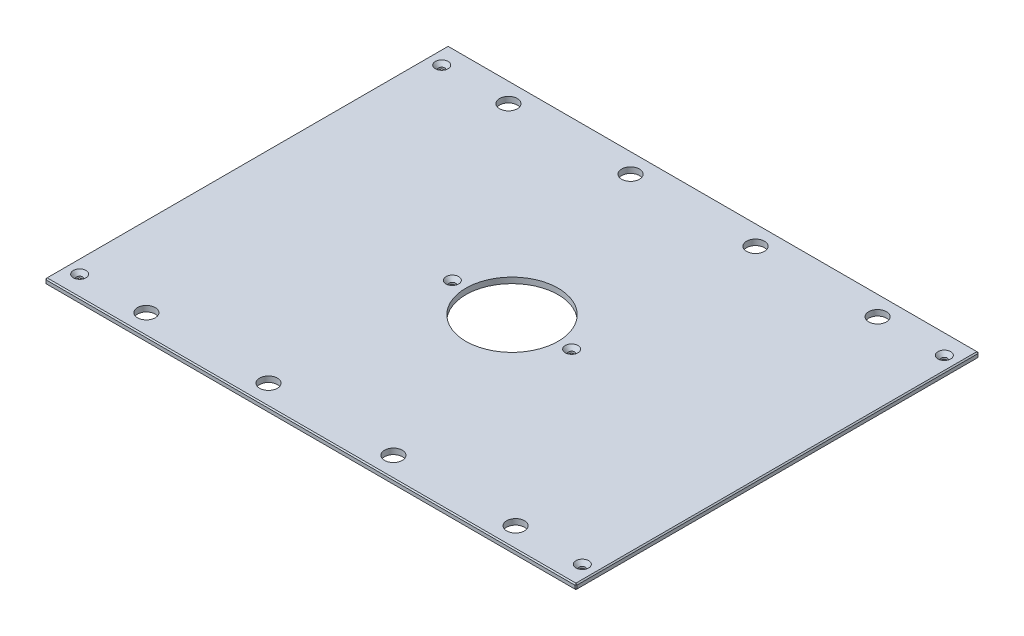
ISO-10303-21;
HEADER;
FILE_DESCRIPTION(('STEP AP214'),'2;1');
FILE_NAME('part.step','',(''),(''),'','','');
FILE_SCHEMA(('AUTOMOTIVE_DESIGN { 1 0 10303 214 1 1 1 1 }'));
ENDSEC;
DATA;
#1=APPLICATION_CONTEXT('core data for automotive mechanical design processes');
#2=APPLICATION_PROTOCOL_DEFINITION('international standard','automotive_design',2000,#1);
#3=PRODUCT_CONTEXT('',#1,'mechanical');
#4=PRODUCT('Part','Part','',(#3));
#5=PRODUCT_RELATED_PRODUCT_CATEGORY('part','',(#4));
#6=PRODUCT_DEFINITION_FORMATION('','',#4);
#7=PRODUCT_DEFINITION_CONTEXT('part definition',#1,'design');
#8=PRODUCT_DEFINITION('design','',#6,#7);
#9=PRODUCT_DEFINITION_SHAPE('','',#8);
#10=(LENGTH_UNIT() NAMED_UNIT(*) SI_UNIT(.MILLI.,.METRE.));
#11=(NAMED_UNIT(*) PLANE_ANGLE_UNIT() SI_UNIT($,.RADIAN.));
#12=(NAMED_UNIT(*) SI_UNIT($,.STERADIAN.) SOLID_ANGLE_UNIT());
#13=UNCERTAINTY_MEASURE_WITH_UNIT(LENGTH_MEASURE(1.E-05),#10,'distance_accuracy_value','');
#14=(GEOMETRIC_REPRESENTATION_CONTEXT(3) GLOBAL_UNCERTAINTY_ASSIGNED_CONTEXT((#13)) GLOBAL_UNIT_ASSIGNED_CONTEXT((#10,
#11,#12)) REPRESENTATION_CONTEXT('',''));
#15=CARTESIAN_POINT('',(0.,0.,0.));
#16=DIRECTION('',(0.,0.,1.));
#17=DIRECTION('',(1.,0.,0.));
#18=AXIS2_PLACEMENT_3D('',#15,#16,#17);
#19=CARTESIAN_POINT('',(-296.8625,6.35,-225.425));
#20=DIRECTION('',(1.,0.,0.));
#21=DIRECTION('',(0.,0.,-1.));
#22=AXIS2_PLACEMENT_3D('',#19,#20,#21);
#23=PLANE('',#22);
#24=DIRECTION('',(0.,0.,-1.));
#25=VECTOR('',#24,1.);
#26=CARTESIAN_POINT('',(-296.8625,5.08000000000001,-225.425));
#27=LINE('',#26,#25);
#28=CARTESIAN_POINT('',(-296.8625,5.08000000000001,224.155));
#29=VERTEX_POINT('',#28);
#30=CARTESIAN_POINT('',(-296.8625,5.08000000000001,-224.155));
#31=VERTEX_POINT('',#30);
#32=EDGE_CURVE('E134',#29,#31,#27,.T.);
#33=ORIENTED_EDGE('',*,*,#32,.T.);
#34=DIRECTION('',(0.,-1.,0.));
#35=VECTOR('',#34,1.);
#36=CARTESIAN_POINT('',(-296.8625,6.35,-224.155));
#37=LINE('',#36,#35);
#38=CARTESIAN_POINT('',(-296.8625,1.26999999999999,-224.155));
#39=VERTEX_POINT('',#38);
#40=EDGE_CURVE('E130',#31,#39,#37,.T.);
#41=ORIENTED_EDGE('',*,*,#40,.T.);
#42=DIRECTION('',(0.,0.,1.));
#43=VECTOR('',#42,1.);
#44=CARTESIAN_POINT('',(-296.8625,1.26999999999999,-225.425));
#45=LINE('',#44,#43);
#46=CARTESIAN_POINT('',(-296.8625,1.26999999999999,224.155));
#47=VERTEX_POINT('',#46);
#48=EDGE_CURVE('E125',#39,#47,#45,.T.);
#49=ORIENTED_EDGE('',*,*,#48,.T.);
#50=DIRECTION('',(0.,1.,0.));
#51=VECTOR('',#50,1.);
#52=CARTESIAN_POINT('',(-296.8625,6.35,224.155));
#53=LINE('',#52,#51);
#54=EDGE_CURVE('E127',#47,#29,#53,.T.);
#55=ORIENTED_EDGE('',*,*,#54,.T.);
#56=EDGE_LOOP('',(#33,#41,#49,#55));
#57=FACE_BOUND('',#56,.T.);
#58=ADVANCED_FACE('F34',(#57),#23,.F.);
#59=CARTESIAN_POINT('',(-296.8625,6.35,225.425));
#60=DIRECTION('',(0.,0.,-1.));
#61=DIRECTION('',(-1.,0.,0.));
#62=AXIS2_PLACEMENT_3D('',#59,#60,#61);
#63=PLANE('',#62);
#64=DIRECTION('',(1.,0.,0.));
#65=VECTOR('',#64,1.);
#66=CARTESIAN_POINT('',(-296.8625,1.26999999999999,225.425));
#67=LINE('',#66,#65);
#68=CARTESIAN_POINT('',(-295.5925,1.26999999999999,225.425));
#69=VERTEX_POINT('',#68);
#70=CARTESIAN_POINT('',(295.5925,1.26999999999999,225.425));
#71=VERTEX_POINT('',#70);
#72=EDGE_CURVE('E57',#69,#71,#67,.T.);
#73=ORIENTED_EDGE('',*,*,#72,.T.);
#74=DIRECTION('',(0.,1.,0.));
#75=VECTOR('',#74,1.);
#76=CARTESIAN_POINT('',(295.5925,6.35,225.425));
#77=LINE('',#76,#75);
#78=CARTESIAN_POINT('',(295.5925,5.08000000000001,225.425));
#79=VERTEX_POINT('',#78);
#80=EDGE_CURVE('E11',#71,#79,#77,.T.);
#81=ORIENTED_EDGE('',*,*,#80,.T.);
#82=DIRECTION('',(-1.,0.,0.));
#83=VECTOR('',#82,1.);
#84=CARTESIAN_POINT('',(-296.8625,5.08000000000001,225.425));
#85=LINE('',#84,#83);
#86=CARTESIAN_POINT('',(-295.5925,5.08000000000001,225.425));
#87=VERTEX_POINT('',#86);
#88=EDGE_CURVE('E43',#79,#87,#85,.T.);
#89=ORIENTED_EDGE('',*,*,#88,.T.);
#90=DIRECTION('',(0.,-1.,0.));
#91=VECTOR('',#90,1.);
#92=CARTESIAN_POINT('',(-295.5925,6.35,225.425));
#93=LINE('',#92,#91);
#94=EDGE_CURVE('E302',#87,#69,#93,.T.);
#95=ORIENTED_EDGE('',*,*,#94,.T.);
#96=EDGE_LOOP('',(#73,#81,#89,#95));
#97=FACE_BOUND('',#96,.T.);
#98=ADVANCED_FACE('F371',(#97),#63,.F.);
#99=CARTESIAN_POINT('',(296.8625,6.35,-225.425));
#100=DIRECTION('',(-1.,0.,0.));
#101=DIRECTION('',(0.,0.,1.));
#102=AXIS2_PLACEMENT_3D('',#99,#100,#101);
#103=PLANE('',#102);
#104=DIRECTION('',(0.,0.,-1.));
#105=VECTOR('',#104,1.);
#106=CARTESIAN_POINT('',(296.8625,1.26999999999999,-225.425));
#107=LINE('',#106,#105);
#108=CARTESIAN_POINT('',(296.8625,1.26999999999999,224.155));
#109=VERTEX_POINT('',#108);
#110=CARTESIAN_POINT('',(296.8625,1.26999999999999,-224.155));
#111=VERTEX_POINT('',#110);
#112=EDGE_CURVE('E297',#109,#111,#107,.T.);
#113=ORIENTED_EDGE('',*,*,#112,.T.);
#114=DIRECTION('',(0.,1.,0.));
#115=VECTOR('',#114,1.);
#116=CARTESIAN_POINT('',(296.8625,6.35,-224.155));
#117=LINE('',#116,#115);
#118=CARTESIAN_POINT('',(296.8625,5.08000000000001,-224.155));
#119=VERTEX_POINT('',#118);
#120=EDGE_CURVE('E299',#111,#119,#117,.T.);
#121=ORIENTED_EDGE('',*,*,#120,.T.);
#122=DIRECTION('',(0.,0.,1.));
#123=VECTOR('',#122,1.);
#124=CARTESIAN_POINT('',(296.8625,5.08000000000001,225.425));
#125=LINE('',#124,#123);
#126=CARTESIAN_POINT('',(296.8625,5.08000000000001,224.155));
#127=VERTEX_POINT('',#126);
#128=EDGE_CURVE('E295',#119,#127,#125,.T.);
#129=ORIENTED_EDGE('',*,*,#128,.T.);
#130=DIRECTION('',(0.,-1.,0.));
#131=VECTOR('',#130,1.);
#132=CARTESIAN_POINT('',(296.8625,6.35,224.155));
#133=LINE('',#132,#131);
#134=EDGE_CURVE('E293',#127,#109,#133,.T.);
#135=ORIENTED_EDGE('',*,*,#134,.T.);
#136=EDGE_LOOP('',(#113,#121,#129,#135));
#137=FACE_BOUND('',#136,.T.);
#138=ADVANCED_FACE('F358',(#137),#103,.F.);
#139=CARTESIAN_POINT('',(-296.8625,6.35,-225.425));
#140=DIRECTION('',(0.,0.,1.));
#141=DIRECTION('',(1.,0.,0.));
#142=AXIS2_PLACEMENT_3D('',#139,#140,#141);
#143=PLANE('',#142);
#144=DIRECTION('',(-1.,0.,0.));
#145=VECTOR('',#144,1.);
#146=CARTESIAN_POINT('',(-296.8625,1.26999999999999,-225.425));
#147=LINE('',#146,#145);
#148=CARTESIAN_POINT('',(295.5925,1.26999999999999,-225.425));
#149=VERTEX_POINT('',#148);
#150=CARTESIAN_POINT('',(-295.5925,1.26999999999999,-225.425));
#151=VERTEX_POINT('',#150);
#152=EDGE_CURVE('E269',#149,#151,#147,.T.);
#153=ORIENTED_EDGE('',*,*,#152,.T.);
#154=DIRECTION('',(0.,1.,0.));
#155=VECTOR('',#154,1.);
#156=CARTESIAN_POINT('',(-295.5925,6.35,-225.425));
#157=LINE('',#156,#155);
#158=CARTESIAN_POINT('',(-295.5925,5.08000000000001,-225.425));
#159=VERTEX_POINT('',#158);
#160=EDGE_CURVE('E273',#151,#159,#157,.T.);
#161=ORIENTED_EDGE('',*,*,#160,.T.);
#162=DIRECTION('',(1.,0.,0.));
#163=VECTOR('',#162,1.);
#164=CARTESIAN_POINT('',(296.8625,5.08000000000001,-225.425));
#165=LINE('',#164,#163);
#166=CARTESIAN_POINT('',(295.5925,5.08000000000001,-225.425));
#167=VERTEX_POINT('',#166);
#168=EDGE_CURVE('E271',#159,#167,#165,.T.);
#169=ORIENTED_EDGE('',*,*,#168,.T.);
#170=DIRECTION('',(0.,-1.,0.));
#171=VECTOR('',#170,1.);
#172=CARTESIAN_POINT('',(295.5925,6.35,-225.425));
#173=LINE('',#172,#171);
#174=EDGE_CURVE('E267',#167,#149,#173,.T.);
#175=ORIENTED_EDGE('',*,*,#174,.T.);
#176=EDGE_LOOP('',(#153,#161,#169,#175));
#177=FACE_BOUND('',#176,.T.);
#178=ADVANCED_FACE('F332',(#177),#143,.F.);
#179=CARTESIAN_POINT('',(0.,6.35,0.));
#180=DIRECTION('',(0.,1.,0.));
#181=DIRECTION('',(0.,0.,1.));
#182=AXIS2_PLACEMENT_3D('',#179,#180,#181);
#183=PLANE('',#182);
#184=CARTESIAN_POINT('',(280.9875,6.35,-202.40498));
#185=DIRECTION('',(0.,1.,0.));
#186=DIRECTION('',(0.,0.,1.));
#187=AXIS2_PLACEMENT_3D('',#184,#185,#186);
#188=CIRCLE('',#187,7.13740000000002);
#189=CARTESIAN_POINT('',(280.9875,6.35,-195.26758));
#190=VERTEX_POINT('',#189);
#191=EDGE_CURVE('E815',#190,#190,#188,.T.);
#192=ORIENTED_EDGE('',*,*,#191,.F.);
#193=EDGE_LOOP('',(#192));
#194=FACE_BOUND('',#193,.T.);
#195=CARTESIAN_POINT('',(280.9875,6.35,202.40498));
#196=DIRECTION('',(0.,1.,0.));
#197=DIRECTION('',(0.,0.,1.));
#198=AXIS2_PLACEMENT_3D('',#195,#196,#197);
#199=CIRCLE('',#198,7.13740000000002);
#200=CARTESIAN_POINT('',(280.9875,6.35,209.54238));
#201=VERTEX_POINT('',#200);
#202=EDGE_CURVE('E819',#201,#201,#199,.T.);
#203=ORIENTED_EDGE('',*,*,#202,.F.);
#204=EDGE_LOOP('',(#203));
#205=FACE_BOUND('',#204,.T.);
#206=CARTESIAN_POINT('',(-280.9875,6.35,202.40498));
#207=DIRECTION('',(0.,1.,0.));
#208=DIRECTION('',(0.,0.,1.));
#209=AXIS2_PLACEMENT_3D('',#206,#207,#208);
#210=CIRCLE('',#209,7.13740000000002);
#211=CARTESIAN_POINT('',(-280.9875,6.35,209.54238));
#212=VERTEX_POINT('',#211);
#213=EDGE_CURVE('E823',#212,#212,#210,.T.);
#214=ORIENTED_EDGE('',*,*,#213,.F.);
#215=EDGE_LOOP('',(#214));
#216=FACE_BOUND('',#215,.T.);
#217=CARTESIAN_POINT('',(-66.675,6.35,0.));
#218=DIRECTION('',(0.,1.,0.));
#219=DIRECTION('',(0.,0.,1.));
#220=AXIS2_PLACEMENT_3D('',#217,#218,#219);
#221=CIRCLE('',#220,7.1374);
#222=CARTESIAN_POINT('',(-66.675,6.35,7.1374));
#223=VERTEX_POINT('',#222);
#224=EDGE_CURVE('E827',#223,#223,#221,.T.);
#225=ORIENTED_EDGE('',*,*,#224,.F.);
#226=EDGE_LOOP('',(#225));
#227=FACE_BOUND('',#226,.T.);
#228=CARTESIAN_POINT('',(66.675,6.35,0.));
#229=DIRECTION('',(0.,1.,0.));
#230=DIRECTION('',(0.,0.,1.));
#231=AXIS2_PLACEMENT_3D('',#228,#229,#230);
#232=CIRCLE('',#231,7.1374);
#233=CARTESIAN_POINT('',(66.675,6.35,7.1374));
#234=VERTEX_POINT('',#233);
#235=EDGE_CURVE('E831',#234,#234,#232,.T.);
#236=ORIENTED_EDGE('',*,*,#235,.F.);
#237=EDGE_LOOP('',(#236));
#238=FACE_BOUND('',#237,.T.);
#239=CARTESIAN_POINT('',(-280.9875,6.35,-202.40498));
#240=DIRECTION('',(0.,1.,0.));
#241=DIRECTION('',(0.,0.,1.));
#242=AXIS2_PLACEMENT_3D('',#239,#240,#241);
#243=CIRCLE('',#242,7.13740000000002);
#244=CARTESIAN_POINT('',(-280.9875,6.35,-195.26758));
#245=VERTEX_POINT('',#244);
#246=EDGE_CURVE('E834',#245,#245,#243,.T.);
#247=ORIENTED_EDGE('',*,*,#246,.F.);
#248=EDGE_LOOP('',(#247));
#249=FACE_BOUND('',#248,.T.);
#250=DIRECTION('',(0.,0.,-1.));
#251=VECTOR('',#250,1.);
#252=CARTESIAN_POINT('',(295.5925,6.35,-225.425));
#253=LINE('',#252,#251);
#254=CARTESIAN_POINT('',(295.5925,6.35,224.155));
#255=VERTEX_POINT('',#254);
#256=CARTESIAN_POINT('',(295.5925,6.35,-224.155));
#257=VERTEX_POINT('',#256);
#258=EDGE_CURVE('E280',#255,#257,#253,.T.);
#259=ORIENTED_EDGE('',*,*,#258,.T.);
#260=DIRECTION('',(-1.,0.,0.));
#261=VECTOR('',#260,1.);
#262=CARTESIAN_POINT('',(-296.8625,6.35,-224.155));
#263=LINE('',#262,#261);
#264=CARTESIAN_POINT('',(-295.5925,6.35,-224.155));
#265=VERTEX_POINT('',#264);
#266=EDGE_CURVE('E282',#257,#265,#263,.T.);
#267=ORIENTED_EDGE('',*,*,#266,.T.);
#268=DIRECTION('',(0.,0.,1.));
#269=VECTOR('',#268,1.);
#270=CARTESIAN_POINT('',(-295.5925,6.35,225.425));
#271=LINE('',#270,#269);
#272=CARTESIAN_POINT('',(-295.5925,6.35,224.155));
#273=VERTEX_POINT('',#272);
#274=EDGE_CURVE('E278',#265,#273,#271,.T.);
#275=ORIENTED_EDGE('',*,*,#274,.T.);
#276=DIRECTION('',(1.,0.,0.));
#277=VECTOR('',#276,1.);
#278=CARTESIAN_POINT('',(296.8625,6.35,224.155));
#279=LINE('',#278,#277);
#280=EDGE_CURVE('E276',#273,#255,#279,.T.);
#281=ORIENTED_EDGE('',*,*,#280,.T.);
#282=EDGE_LOOP('',(#259,#267,#275,#281));
#283=FACE_BOUND('',#282,.T.);
#284=CARTESIAN_POINT('',(206.375,6.35,-202.40498));
#285=DIRECTION('',(0.,1.,0.));
#286=DIRECTION('',(0.,0.,1.));
#287=AXIS2_PLACEMENT_3D('',#284,#285,#286);
#288=CIRCLE('',#287,9.921875);
#289=CARTESIAN_POINT('',(206.375,6.35,-192.483105));
#290=VERTEX_POINT('',#289);
#291=EDGE_CURVE('E203',#290,#290,#288,.T.);
#292=ORIENTED_EDGE('',*,*,#291,.F.);
#293=EDGE_LOOP('',(#292));
#294=FACE_BOUND('',#293,.T.);
#295=CARTESIAN_POINT('',(-206.375,6.35,-202.40498));
#296=DIRECTION('',(0.,1.,0.));
#297=DIRECTION('',(0.,0.,1.));
#298=AXIS2_PLACEMENT_3D('',#295,#296,#297);
#299=CIRCLE('',#298,9.921875);
#300=CARTESIAN_POINT('',(-206.375,6.35,-192.483105));
#301=VERTEX_POINT('',#300);
#302=EDGE_CURVE('E213',#301,#301,#299,.T.);
#303=ORIENTED_EDGE('',*,*,#302,.F.);
#304=EDGE_LOOP('',(#303));
#305=FACE_BOUND('',#304,.T.);
#306=CARTESIAN_POINT('',(206.375,6.35,202.40498));
#307=DIRECTION('',(0.,1.,0.));
#308=DIRECTION('',(0.,0.,1.));
#309=AXIS2_PLACEMENT_3D('',#306,#307,#308);
#310=CIRCLE('',#309,9.921875);
#311=CARTESIAN_POINT('',(206.375,6.35,212.326855));
#312=VERTEX_POINT('',#311);
#313=EDGE_CURVE('E224',#312,#312,#310,.T.);
#314=ORIENTED_EDGE('',*,*,#313,.F.);
#315=EDGE_LOOP('',(#314));
#316=FACE_BOUND('',#315,.T.);
#317=CARTESIAN_POINT('',(-206.375,6.35,202.40498));
#318=DIRECTION('',(0.,1.,0.));
#319=DIRECTION('',(0.,0.,1.));
#320=AXIS2_PLACEMENT_3D('',#317,#318,#319);
#321=CIRCLE('',#320,9.921875);
#322=CARTESIAN_POINT('',(-206.375,6.35,212.326855));
#323=VERTEX_POINT('',#322);
#324=EDGE_CURVE('E230',#323,#323,#321,.T.);
#325=ORIENTED_EDGE('',*,*,#324,.F.);
#326=EDGE_LOOP('',(#325));
#327=FACE_BOUND('',#326,.T.);
#328=CARTESIAN_POINT('',(-69.85,6.35,-202.40498));
#329=DIRECTION('',(0.,1.,0.));
#330=DIRECTION('',(0.,0.,1.));
#331=AXIS2_PLACEMENT_3D('',#328,#329,#330);
#332=CIRCLE('',#331,9.921875);
#333=CARTESIAN_POINT('',(-69.85,6.35,-192.483105));
#334=VERTEX_POINT('',#333);
#335=EDGE_CURVE('E236',#334,#334,#332,.T.);
#336=ORIENTED_EDGE('',*,*,#335,.F.);
#337=EDGE_LOOP('',(#336));
#338=FACE_BOUND('',#337,.T.);
#339=CARTESIAN_POINT('',(69.85,6.35,-202.40498));
#340=DIRECTION('',(0.,1.,0.));
#341=DIRECTION('',(0.,0.,1.));
#342=AXIS2_PLACEMENT_3D('',#339,#340,#341);
#343=CIRCLE('',#342,9.921875);
#344=CARTESIAN_POINT('',(69.85,6.35,-192.483105));
#345=VERTEX_POINT('',#344);
#346=EDGE_CURVE('E242',#345,#345,#343,.T.);
#347=ORIENTED_EDGE('',*,*,#346,.F.);
#348=EDGE_LOOP('',(#347));
#349=FACE_BOUND('',#348,.T.);
#350=CARTESIAN_POINT('',(69.85,6.35,202.40498));
#351=DIRECTION('',(0.,1.,0.));
#352=DIRECTION('',(0.,0.,1.));
#353=AXIS2_PLACEMENT_3D('',#350,#351,#352);
#354=CIRCLE('',#353,9.921875);
#355=CARTESIAN_POINT('',(69.85,6.35,212.326855));
#356=VERTEX_POINT('',#355);
#357=EDGE_CURVE('E248',#356,#356,#354,.T.);
#358=ORIENTED_EDGE('',*,*,#357,.F.);
#359=EDGE_LOOP('',(#358));
#360=FACE_BOUND('',#359,.T.);
#361=CARTESIAN_POINT('',(-69.85,6.35,202.40498));
#362=DIRECTION('',(0.,1.,0.));
#363=DIRECTION('',(0.,0.,1.));
#364=AXIS2_PLACEMENT_3D('',#361,#362,#363);
#365=CIRCLE('',#364,9.921875);
#366=CARTESIAN_POINT('',(-69.85,6.35,212.326855));
#367=VERTEX_POINT('',#366);
#368=EDGE_CURVE('E254',#367,#367,#365,.T.);
#369=ORIENTED_EDGE('',*,*,#368,.F.);
#370=EDGE_LOOP('',(#369));
#371=FACE_BOUND('',#370,.T.);
#372=CARTESIAN_POINT('',(0.,6.35,0.));
#373=DIRECTION('',(0.,1.,0.));
#374=DIRECTION('',(0.,0.,1.));
#375=AXIS2_PLACEMENT_3D('',#372,#373,#374);
#376=CIRCLE('',#375,51.562);
#377=CARTESIAN_POINT('',(0.,6.35,51.562));
#378=VERTEX_POINT('',#377);
#379=EDGE_CURVE('E260',#378,#378,#376,.T.);
#380=ORIENTED_EDGE('',*,*,#379,.F.);
#381=EDGE_LOOP('',(#380));
#382=FACE_BOUND('',#381,.T.);
#383=ADVANCED_FACE('F380',(#194,#205,#216,#227,#238,#249,#283,#294,#305,#316,#327,#338,#349,
#360,#371,#382),#183,.T.);
#384=CARTESIAN_POINT('',(0.,0.,0.));
#385=DIRECTION('',(0.,1.,0.));
#386=DIRECTION('',(0.,0.,1.));
#387=AXIS2_PLACEMENT_3D('',#384,#385,#386);
#388=PLANE('',#387);
#389=CARTESIAN_POINT('',(280.9875,0.,-202.40498));
#390=DIRECTION('',(0.,1.,0.));
#391=DIRECTION('',(0.,0.,1.));
#392=AXIS2_PLACEMENT_3D('',#389,#390,#391);
#393=CIRCLE('',#392,3.3782);
#394=CARTESIAN_POINT('',(280.9875,0.,-199.02678));
#395=VERTEX_POINT('',#394);
#396=EDGE_CURVE('E868',#395,#395,#393,.T.);
#397=ORIENTED_EDGE('',*,*,#396,.T.);
#398=EDGE_LOOP('',(#397));
#399=FACE_BOUND('',#398,.T.);
#400=CARTESIAN_POINT('',(280.9875,0.,202.40498));
#401=DIRECTION('',(0.,1.,0.));
#402=DIRECTION('',(0.,0.,1.));
#403=AXIS2_PLACEMENT_3D('',#400,#401,#402);
#404=CIRCLE('',#403,3.3782);
#405=CARTESIAN_POINT('',(280.9875,0.,205.78318));
#406=VERTEX_POINT('',#405);
#407=EDGE_CURVE('E861',#406,#406,#404,.T.);
#408=ORIENTED_EDGE('',*,*,#407,.T.);
#409=EDGE_LOOP('',(#408));
#410=FACE_BOUND('',#409,.T.);
#411=CARTESIAN_POINT('',(-280.9875,0.,202.40498));
#412=DIRECTION('',(0.,1.,0.));
#413=DIRECTION('',(0.,0.,1.));
#414=AXIS2_PLACEMENT_3D('',#411,#412,#413);
#415=CIRCLE('',#414,3.3782);
#416=CARTESIAN_POINT('',(-280.9875,0.,205.78318));
#417=VERTEX_POINT('',#416);
#418=EDGE_CURVE('E854',#417,#417,#415,.T.);
#419=ORIENTED_EDGE('',*,*,#418,.T.);
#420=EDGE_LOOP('',(#419));
#421=FACE_BOUND('',#420,.T.);
#422=CARTESIAN_POINT('',(-66.675,0.,0.));
#423=DIRECTION('',(0.,1.,0.));
#424=DIRECTION('',(0.,0.,1.));
#425=AXIS2_PLACEMENT_3D('',#422,#423,#424);
#426=CIRCLE('',#425,3.3782);
#427=CARTESIAN_POINT('',(-66.675,0.,3.3782));
#428=VERTEX_POINT('',#427);
#429=EDGE_CURVE('E847',#428,#428,#426,.T.);
#430=ORIENTED_EDGE('',*,*,#429,.T.);
#431=EDGE_LOOP('',(#430));
#432=FACE_BOUND('',#431,.T.);
#433=CARTESIAN_POINT('',(66.675,0.,0.));
#434=DIRECTION('',(0.,1.,0.));
#435=DIRECTION('',(0.,0.,1.));
#436=AXIS2_PLACEMENT_3D('',#433,#434,#435);
#437=CIRCLE('',#436,3.3782);
#438=CARTESIAN_POINT('',(66.675,0.,3.3782));
#439=VERTEX_POINT('',#438);
#440=EDGE_CURVE('E837',#439,#439,#437,.T.);
#441=ORIENTED_EDGE('',*,*,#440,.T.);
#442=EDGE_LOOP('',(#441));
#443=FACE_BOUND('',#442,.T.);
#444=CARTESIAN_POINT('',(-280.9875,0.,-202.40498));
#445=DIRECTION('',(0.,1.,0.));
#446=DIRECTION('',(0.,0.,1.));
#447=AXIS2_PLACEMENT_3D('',#444,#445,#446);
#448=CIRCLE('',#447,3.3782);
#449=CARTESIAN_POINT('',(-280.9875,0.,-199.02678));
#450=VERTEX_POINT('',#449);
#451=EDGE_CURVE('E216',#450,#450,#448,.T.);
#452=ORIENTED_EDGE('',*,*,#451,.T.);
#453=EDGE_LOOP('',(#452));
#454=FACE_BOUND('',#453,.T.);
#455=DIRECTION('',(0.,0.,-1.));
#456=VECTOR('',#455,1.);
#457=CARTESIAN_POINT('',(-295.5925,0.,0.));
#458=LINE('',#457,#456);
#459=CARTESIAN_POINT('',(-295.5925,0.,224.155));
#460=VERTEX_POINT('',#459);
#461=CARTESIAN_POINT('',(-295.5925,0.,-224.155));
#462=VERTEX_POINT('',#461);
#463=EDGE_CURVE('E157',#460,#462,#458,.T.);
#464=ORIENTED_EDGE('',*,*,#463,.T.);
#465=DIRECTION('',(1.,0.,0.));
#466=VECTOR('',#465,1.);
#467=CARTESIAN_POINT('',(0.,0.,-224.155));
#468=LINE('',#467,#466);
#469=CARTESIAN_POINT('',(295.5925,0.,-224.155));
#470=VERTEX_POINT('',#469);
#471=EDGE_CURVE('E290',#462,#470,#468,.T.);
#472=ORIENTED_EDGE('',*,*,#471,.T.);
#473=DIRECTION('',(0.,0.,1.));
#474=VECTOR('',#473,1.);
#475=CARTESIAN_POINT('',(295.5925,0.,0.));
#476=LINE('',#475,#474);
#477=CARTESIAN_POINT('',(295.5925,0.,224.155));
#478=VERTEX_POINT('',#477);
#479=EDGE_CURVE('E288',#470,#478,#476,.T.);
#480=ORIENTED_EDGE('',*,*,#479,.T.);
#481=DIRECTION('',(-1.,0.,0.));
#482=VECTOR('',#481,1.);
#483=CARTESIAN_POINT('',(0.,0.,224.155));
#484=LINE('',#483,#482);
#485=EDGE_CURVE('E285',#478,#460,#484,.T.);
#486=ORIENTED_EDGE('',*,*,#485,.T.);
#487=EDGE_LOOP('',(#464,#472,#480,#486));
#488=FACE_BOUND('',#487,.T.);
#489=CARTESIAN_POINT('',(206.375,0.,-202.40498));
#490=DIRECTION('',(0.,1.,0.));
#491=DIRECTION('',(0.,0.,1.));
#492=AXIS2_PLACEMENT_3D('',#489,#490,#491);
#493=CIRCLE('',#492,9.921875);
#494=CARTESIAN_POINT('',(206.375,0.,-192.483105));
#495=VERTEX_POINT('',#494);
#496=EDGE_CURVE('E208',#495,#495,#493,.T.);
#497=ORIENTED_EDGE('',*,*,#496,.T.);
#498=EDGE_LOOP('',(#497));
#499=FACE_BOUND('',#498,.T.);
#500=CARTESIAN_POINT('',(-206.375,0.,-202.40498));
#501=DIRECTION('',(0.,1.,0.));
#502=DIRECTION('',(0.,0.,1.));
#503=AXIS2_PLACEMENT_3D('',#500,#501,#502);
#504=CIRCLE('',#503,9.921875);
#505=CARTESIAN_POINT('',(-206.375,0.,-192.483105));
#506=VERTEX_POINT('',#505);
#507=EDGE_CURVE('E221',#506,#506,#504,.T.);
#508=ORIENTED_EDGE('',*,*,#507,.T.);
#509=EDGE_LOOP('',(#508));
#510=FACE_BOUND('',#509,.T.);
#511=CARTESIAN_POINT('',(206.375,0.,202.40498));
#512=DIRECTION('',(0.,1.,0.));
#513=DIRECTION('',(0.,0.,1.));
#514=AXIS2_PLACEMENT_3D('',#511,#512,#513);
#515=CIRCLE('',#514,9.921875);
#516=CARTESIAN_POINT('',(206.375,0.,212.326855));
#517=VERTEX_POINT('',#516);
#518=EDGE_CURVE('E227',#517,#517,#515,.T.);
#519=ORIENTED_EDGE('',*,*,#518,.T.);
#520=EDGE_LOOP('',(#519));
#521=FACE_BOUND('',#520,.T.);
#522=CARTESIAN_POINT('',(-206.375,0.,202.40498));
#523=DIRECTION('',(0.,1.,0.));
#524=DIRECTION('',(0.,0.,1.));
#525=AXIS2_PLACEMENT_3D('',#522,#523,#524);
#526=CIRCLE('',#525,9.921875);
#527=CARTESIAN_POINT('',(-206.375,0.,212.326855));
#528=VERTEX_POINT('',#527);
#529=EDGE_CURVE('E233',#528,#528,#526,.T.);
#530=ORIENTED_EDGE('',*,*,#529,.T.);
#531=EDGE_LOOP('',(#530));
#532=FACE_BOUND('',#531,.T.);
#533=CARTESIAN_POINT('',(-69.85,0.,-202.40498));
#534=DIRECTION('',(0.,1.,0.));
#535=DIRECTION('',(0.,0.,1.));
#536=AXIS2_PLACEMENT_3D('',#533,#534,#535);
#537=CIRCLE('',#536,9.921875);
#538=CARTESIAN_POINT('',(-69.85,0.,-192.483105));
#539=VERTEX_POINT('',#538);
#540=EDGE_CURVE('E239',#539,#539,#537,.T.);
#541=ORIENTED_EDGE('',*,*,#540,.T.);
#542=EDGE_LOOP('',(#541));
#543=FACE_BOUND('',#542,.T.);
#544=CARTESIAN_POINT('',(69.85,0.,-202.40498));
#545=DIRECTION('',(0.,1.,0.));
#546=DIRECTION('',(0.,0.,1.));
#547=AXIS2_PLACEMENT_3D('',#544,#545,#546);
#548=CIRCLE('',#547,9.921875);
#549=CARTESIAN_POINT('',(69.85,0.,-192.483105));
#550=VERTEX_POINT('',#549);
#551=EDGE_CURVE('E245',#550,#550,#548,.T.);
#552=ORIENTED_EDGE('',*,*,#551,.T.);
#553=EDGE_LOOP('',(#552));
#554=FACE_BOUND('',#553,.T.);
#555=CARTESIAN_POINT('',(69.85,0.,202.40498));
#556=DIRECTION('',(0.,1.,0.));
#557=DIRECTION('',(0.,0.,1.));
#558=AXIS2_PLACEMENT_3D('',#555,#556,#557);
#559=CIRCLE('',#558,9.921875);
#560=CARTESIAN_POINT('',(69.85,0.,212.326855));
#561=VERTEX_POINT('',#560);
#562=EDGE_CURVE('E251',#561,#561,#559,.T.);
#563=ORIENTED_EDGE('',*,*,#562,.T.);
#564=EDGE_LOOP('',(#563));
#565=FACE_BOUND('',#564,.T.);
#566=CARTESIAN_POINT('',(-69.85,0.,202.40498));
#567=DIRECTION('',(0.,1.,0.));
#568=DIRECTION('',(0.,0.,1.));
#569=AXIS2_PLACEMENT_3D('',#566,#567,#568);
#570=CIRCLE('',#569,9.921875);
#571=CARTESIAN_POINT('',(-69.85,0.,212.326855));
#572=VERTEX_POINT('',#571);
#573=EDGE_CURVE('E257',#572,#572,#570,.T.);
#574=ORIENTED_EDGE('',*,*,#573,.T.);
#575=EDGE_LOOP('',(#574));
#576=FACE_BOUND('',#575,.T.);
#577=CARTESIAN_POINT('',(0.,0.,0.));
#578=DIRECTION('',(0.,1.,0.));
#579=DIRECTION('',(0.,0.,1.));
#580=AXIS2_PLACEMENT_3D('',#577,#578,#579);
#581=CIRCLE('',#580,51.562);
#582=CARTESIAN_POINT('',(0.,0.,51.562));
#583=VERTEX_POINT('',#582);
#584=EDGE_CURVE('E146',#583,#583,#581,.T.);
#585=ORIENTED_EDGE('',*,*,#584,.T.);
#586=EDGE_LOOP('',(#585));
#587=FACE_BOUND('',#586,.T.);
#588=ADVANCED_FACE('F345',(#399,#410,#421,#432,#443,#454,#488,#499,#510,#521,#532,#543,#554,
#565,#576,#587),#388,.F.);
#589=CARTESIAN_POINT('',(0.,0.,0.));
#590=DIRECTION('',(0.,1.,0.));
#591=DIRECTION('',(0.,0.,1.));
#592=AXIS2_PLACEMENT_3D('',#589,#590,#591);
#593=CYLINDRICAL_SURFACE('',#592,51.562);
#594=ORIENTED_EDGE('',*,*,#584,.F.);
#595=EDGE_LOOP('',(#594));
#596=FACE_BOUND('',#595,.T.);
#597=ORIENTED_EDGE('',*,*,#379,.T.);
#598=EDGE_LOOP('',(#597));
#599=FACE_BOUND('',#598,.T.);
#600=ADVANCED_FACE('F750',(#596,#599),#593,.F.);
#601=CARTESIAN_POINT('',(-69.85,6.35,202.40498));
#602=DIRECTION('',(0.,1.,0.));
#603=DIRECTION('',(0.,0.,1.));
#604=AXIS2_PLACEMENT_3D('',#601,#602,#603);
#605=CYLINDRICAL_SURFACE('',#604,9.921875);
#606=ORIENTED_EDGE('',*,*,#573,.F.);
#607=EDGE_LOOP('',(#606));
#608=FACE_BOUND('',#607,.T.);
#609=ORIENTED_EDGE('',*,*,#368,.T.);
#610=EDGE_LOOP('',(#609));
#611=FACE_BOUND('',#610,.T.);
#612=ADVANCED_FACE('F741',(#608,#611),#605,.F.);
#613=CARTESIAN_POINT('',(69.85,6.35,202.40498));
#614=DIRECTION('',(0.,1.,0.));
#615=DIRECTION('',(0.,0.,1.));
#616=AXIS2_PLACEMENT_3D('',#613,#614,#615);
#617=CYLINDRICAL_SURFACE('',#616,9.921875);
#618=ORIENTED_EDGE('',*,*,#562,.F.);
#619=EDGE_LOOP('',(#618));
#620=FACE_BOUND('',#619,.T.);
#621=ORIENTED_EDGE('',*,*,#357,.T.);
#622=EDGE_LOOP('',(#621));
#623=FACE_BOUND('',#622,.T.);
#624=ADVANCED_FACE('F732',(#620,#623),#617,.F.);
#625=CARTESIAN_POINT('',(69.85,6.35,-202.40498));
#626=DIRECTION('',(0.,1.,0.));
#627=DIRECTION('',(0.,0.,1.));
#628=AXIS2_PLACEMENT_3D('',#625,#626,#627);
#629=CYLINDRICAL_SURFACE('',#628,9.921875);
#630=ORIENTED_EDGE('',*,*,#551,.F.);
#631=EDGE_LOOP('',(#630));
#632=FACE_BOUND('',#631,.T.);
#633=ORIENTED_EDGE('',*,*,#346,.T.);
#634=EDGE_LOOP('',(#633));
#635=FACE_BOUND('',#634,.T.);
#636=ADVANCED_FACE('F723',(#632,#635),#629,.F.);
#637=CARTESIAN_POINT('',(-69.85,6.35,-202.40498));
#638=DIRECTION('',(0.,1.,0.));
#639=DIRECTION('',(0.,0.,1.));
#640=AXIS2_PLACEMENT_3D('',#637,#638,#639);
#641=CYLINDRICAL_SURFACE('',#640,9.921875);
#642=ORIENTED_EDGE('',*,*,#540,.F.);
#643=EDGE_LOOP('',(#642));
#644=FACE_BOUND('',#643,.T.);
#645=ORIENTED_EDGE('',*,*,#335,.T.);
#646=EDGE_LOOP('',(#645));
#647=FACE_BOUND('',#646,.T.);
#648=ADVANCED_FACE('F714',(#644,#647),#641,.F.);
#649=CARTESIAN_POINT('',(-206.375,6.35,202.40498));
#650=DIRECTION('',(0.,1.,0.));
#651=DIRECTION('',(0.,0.,1.));
#652=AXIS2_PLACEMENT_3D('',#649,#650,#651);
#653=CYLINDRICAL_SURFACE('',#652,9.921875);
#654=ORIENTED_EDGE('',*,*,#529,.F.);
#655=EDGE_LOOP('',(#654));
#656=FACE_BOUND('',#655,.T.);
#657=ORIENTED_EDGE('',*,*,#324,.T.);
#658=EDGE_LOOP('',(#657));
#659=FACE_BOUND('',#658,.T.);
#660=ADVANCED_FACE('F705',(#656,#659),#653,.F.);
#661=CARTESIAN_POINT('',(206.375,6.35,202.40498));
#662=DIRECTION('',(0.,1.,0.));
#663=DIRECTION('',(0.,0.,1.));
#664=AXIS2_PLACEMENT_3D('',#661,#662,#663);
#665=CYLINDRICAL_SURFACE('',#664,9.921875);
#666=ORIENTED_EDGE('',*,*,#518,.F.);
#667=EDGE_LOOP('',(#666));
#668=FACE_BOUND('',#667,.T.);
#669=ORIENTED_EDGE('',*,*,#313,.T.);
#670=EDGE_LOOP('',(#669));
#671=FACE_BOUND('',#670,.T.);
#672=ADVANCED_FACE('F696',(#668,#671),#665,.F.);
#673=CARTESIAN_POINT('',(-206.375,6.35,-202.40498));
#674=DIRECTION('',(0.,1.,0.));
#675=DIRECTION('',(0.,0.,1.));
#676=AXIS2_PLACEMENT_3D('',#673,#674,#675);
#677=CYLINDRICAL_SURFACE('',#676,9.921875);
#678=ORIENTED_EDGE('',*,*,#507,.F.);
#679=EDGE_LOOP('',(#678));
#680=FACE_BOUND('',#679,.T.);
#681=ORIENTED_EDGE('',*,*,#302,.T.);
#682=EDGE_LOOP('',(#681));
#683=FACE_BOUND('',#682,.T.);
#684=ADVANCED_FACE('F686',(#680,#683),#677,.F.);
#685=CARTESIAN_POINT('',(206.375,6.35,-202.40498));
#686=DIRECTION('',(0.,1.,0.));
#687=DIRECTION('',(0.,0.,1.));
#688=AXIS2_PLACEMENT_3D('',#685,#686,#687);
#689=CYLINDRICAL_SURFACE('',#688,9.921875);
#690=ORIENTED_EDGE('',*,*,#496,.F.);
#691=EDGE_LOOP('',(#690));
#692=FACE_BOUND('',#691,.T.);
#693=ORIENTED_EDGE('',*,*,#291,.T.);
#694=EDGE_LOOP('',(#693));
#695=FACE_BOUND('',#694,.T.);
#696=ADVANCED_FACE('F389',(#692,#695),#689,.F.);
#697=CARTESIAN_POINT('',(296.8625,6.35,224.155));
#698=DIRECTION('',(-0.707106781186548,0.,-0.707106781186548));
#699=DIRECTION('',(0.,-1.,0.));
#700=AXIS2_PLACEMENT_3D('',#697,#698,#699);
#701=PLANE('',#700);
#702=DIRECTION('',(-0.707106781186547,0.,0.707106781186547));
#703=VECTOR('',#702,1.);
#704=CARTESIAN_POINT('',(296.8625,5.08000000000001,224.155));
#705=LINE('',#704,#703);
#706=EDGE_CURVE('E38',#79,#127,#705,.F.);
#707=ORIENTED_EDGE('',*,*,#706,.F.);
#708=ORIENTED_EDGE('',*,*,#80,.F.);
#709=DIRECTION('',(0.707106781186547,0.,-0.707106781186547));
#710=VECTOR('',#709,1.);
#711=CARTESIAN_POINT('',(296.2275,1.26999999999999,224.79));
#712=LINE('',#711,#710);
#713=EDGE_CURVE('E196',#109,#71,#712,.F.);
#714=ORIENTED_EDGE('',*,*,#713,.F.);
#715=ORIENTED_EDGE('',*,*,#134,.F.);
#716=EDGE_LOOP('',(#707,#708,#714,#715));
#717=FACE_BOUND('',#716,.T.);
#718=ADVANCED_FACE('F36',(#717),#701,.F.);
#719=CARTESIAN_POINT('',(296.8625,5.08000000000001,224.155));
#720=DIRECTION('',(0.577350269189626,0.577350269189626,0.577350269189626));
#721=DIRECTION('',(0.707106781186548,0.,-0.707106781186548));
#722=AXIS2_PLACEMENT_3D('',#719,#720,#721);
#723=PLANE('',#722);
#724=DIRECTION('',(0.,-0.707106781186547,0.707106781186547));
#725=VECTOR('',#724,1.);
#726=CARTESIAN_POINT('',(295.5925,5.715,224.79));
#727=LINE('',#726,#725);
#728=EDGE_CURVE('E192',#79,#255,#727,.F.);
#729=ORIENTED_EDGE('',*,*,#728,.F.);
#730=ORIENTED_EDGE('',*,*,#706,.T.);
#731=DIRECTION('',(-0.707106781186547,0.707106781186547,0.));
#732=VECTOR('',#731,1.);
#733=CARTESIAN_POINT('',(296.8625,5.08000000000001,224.155));
#734=LINE('',#733,#732);
#735=EDGE_CURVE('E194',#255,#127,#734,.F.);
#736=ORIENTED_EDGE('',*,*,#735,.F.);
#737=EDGE_LOOP('',(#729,#730,#736));
#738=FACE_BOUND('',#737,.T.);
#739=ADVANCED_FACE('F382',(#738),#723,.T.);
#740=CARTESIAN_POINT('',(295.5925,0.,224.155));
#741=DIRECTION('',(0.577350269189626,-0.577350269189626,0.577350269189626));
#742=DIRECTION('',(0.707106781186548,0.,-0.707106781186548));
#743=AXIS2_PLACEMENT_3D('',#740,#741,#742);
#744=PLANE('',#743);
#745=DIRECTION('',(-0.707106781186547,-0.707106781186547,0.));
#746=VECTOR('',#745,1.);
#747=CARTESIAN_POINT('',(295.5925,0.,224.155));
#748=LINE('',#747,#746);
#749=EDGE_CURVE('E186',#109,#478,#748,.T.);
#750=ORIENTED_EDGE('',*,*,#749,.F.);
#751=ORIENTED_EDGE('',*,*,#713,.T.);
#752=DIRECTION('',(0.,0.707106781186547,0.707106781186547));
#753=VECTOR('',#752,1.);
#754=CARTESIAN_POINT('',(295.5925,0.,224.155));
#755=LINE('',#754,#753);
#756=EDGE_CURVE('E189',#478,#71,#755,.T.);
#757=ORIENTED_EDGE('',*,*,#756,.F.);
#758=EDGE_LOOP('',(#750,#751,#757));
#759=FACE_BOUND('',#758,.T.);
#760=ADVANCED_FACE('F351',(#759),#744,.T.);
#761=CARTESIAN_POINT('',(295.5925,6.35,0.));
#762=DIRECTION('',(0.707106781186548,0.707106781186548,0.));
#763=DIRECTION('',(0.,0.,1.));
#764=AXIS2_PLACEMENT_3D('',#761,#762,#763);
#765=PLANE('',#764);
#766=ORIENTED_EDGE('',*,*,#735,.T.);
#767=ORIENTED_EDGE('',*,*,#128,.F.);
#768=DIRECTION('',(0.707106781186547,-0.707106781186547,0.));
#769=VECTOR('',#768,1.);
#770=CARTESIAN_POINT('',(296.2275,5.715,-224.155));
#771=LINE('',#770,#769);
#772=EDGE_CURVE('E181',#257,#119,#771,.T.);
#773=ORIENTED_EDGE('',*,*,#772,.F.);
#774=ORIENTED_EDGE('',*,*,#258,.F.);
#775=EDGE_LOOP('',(#766,#767,#773,#774));
#776=FACE_BOUND('',#775,.T.);
#777=ADVANCED_FACE('F368',(#776),#765,.T.);
#778=CARTESIAN_POINT('',(0.,6.35,224.155));
#779=DIRECTION('',(0.,0.707106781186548,0.707106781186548));
#780=DIRECTION('',(-1.,0.,0.));
#781=AXIS2_PLACEMENT_3D('',#778,#779,#780);
#782=PLANE('',#781);
#783=ORIENTED_EDGE('',*,*,#728,.T.);
#784=ORIENTED_EDGE('',*,*,#280,.F.);
#785=DIRECTION('',(0.,0.707106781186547,-0.707106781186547));
#786=VECTOR('',#785,1.);
#787=CARTESIAN_POINT('',(-295.5925,6.35,224.155));
#788=LINE('',#787,#786);
#789=EDGE_CURVE('E178',#87,#273,#788,.T.);
#790=ORIENTED_EDGE('',*,*,#789,.F.);
#791=ORIENTED_EDGE('',*,*,#88,.F.);
#792=EDGE_LOOP('',(#783,#784,#790,#791));
#793=FACE_BOUND('',#792,.T.);
#794=ADVANCED_FACE('F373',(#793),#782,.T.);
#795=CARTESIAN_POINT('',(-295.5925,6.35,225.425));
#796=DIRECTION('',(0.707106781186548,0.,-0.707106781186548));
#797=DIRECTION('',(0.,-1.,0.));
#798=AXIS2_PLACEMENT_3D('',#795,#796,#797);
#799=PLANE('',#798);
#800=DIRECTION('',(0.707106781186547,0.,0.707106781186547));
#801=VECTOR('',#800,1.);
#802=CARTESIAN_POINT('',(-296.8625,1.26999999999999,224.155));
#803=LINE('',#802,#801);
#804=EDGE_CURVE('E141',#69,#47,#803,.F.);
#805=ORIENTED_EDGE('',*,*,#804,.F.);
#806=ORIENTED_EDGE('',*,*,#94,.F.);
#807=DIRECTION('',(-0.707106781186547,0.,-0.707106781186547));
#808=VECTOR('',#807,1.);
#809=CARTESIAN_POINT('',(-296.2275,5.08000000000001,224.79));
#810=LINE('',#809,#808);
#811=EDGE_CURVE('E144',#29,#87,#810,.F.);
#812=ORIENTED_EDGE('',*,*,#811,.F.);
#813=ORIENTED_EDGE('',*,*,#54,.F.);
#814=EDGE_LOOP('',(#805,#806,#812,#813));
#815=FACE_BOUND('',#814,.T.);
#816=ADVANCED_FACE('F139',(#815),#799,.F.);
#817=CARTESIAN_POINT('',(-296.8625,1.26999999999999,225.425));
#818=DIRECTION('',(0.,0.707106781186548,-0.707106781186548));
#819=DIRECTION('',(1.,0.,0.));
#820=AXIS2_PLACEMENT_3D('',#817,#818,#819);
#821=PLANE('',#820);
#822=ORIENTED_EDGE('',*,*,#756,.T.);
#823=ORIENTED_EDGE('',*,*,#72,.F.);
#824=DIRECTION('',(0.,-0.707106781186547,-0.707106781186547));
#825=VECTOR('',#824,1.);
#826=CARTESIAN_POINT('',(-295.5925,0.634999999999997,224.79));
#827=LINE('',#826,#825);
#828=EDGE_CURVE('E154',#460,#69,#827,.F.);
#829=ORIENTED_EDGE('',*,*,#828,.F.);
#830=ORIENTED_EDGE('',*,*,#485,.F.);
#831=EDGE_LOOP('',(#822,#823,#829,#830));
#832=FACE_BOUND('',#831,.T.);
#833=ADVANCED_FACE('F350',(#832),#821,.F.);
#834=CARTESIAN_POINT('',(296.8625,1.26999999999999,-225.425));
#835=DIRECTION('',(-0.707106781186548,0.707106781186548,0.));
#836=DIRECTION('',(0.,0.,-1.));
#837=AXIS2_PLACEMENT_3D('',#834,#835,#836);
#838=PLANE('',#837);
#839=ORIENTED_EDGE('',*,*,#749,.T.);
#840=ORIENTED_EDGE('',*,*,#479,.F.);
#841=DIRECTION('',(0.707106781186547,0.707106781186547,0.));
#842=VECTOR('',#841,1.);
#843=CARTESIAN_POINT('',(295.5925,0.,-224.155));
#844=LINE('',#843,#842);
#845=EDGE_CURVE('E173',#111,#470,#844,.F.);
#846=ORIENTED_EDGE('',*,*,#845,.F.);
#847=ORIENTED_EDGE('',*,*,#112,.F.);
#848=EDGE_LOOP('',(#839,#840,#846,#847));
#849=FACE_BOUND('',#848,.T.);
#850=ADVANCED_FACE('F355',(#849),#838,.F.);
#851=CARTESIAN_POINT('',(295.5925,6.35,-225.425));
#852=DIRECTION('',(-0.707106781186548,0.,0.707106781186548));
#853=DIRECTION('',(0.,-1.,0.));
#854=AXIS2_PLACEMENT_3D('',#851,#852,#853);
#855=PLANE('',#854);
#856=DIRECTION('',(0.707106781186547,0.,0.707106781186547));
#857=VECTOR('',#856,1.);
#858=CARTESIAN_POINT('',(295.5925,5.08000000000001,-225.425));
#859=LINE('',#858,#857);
#860=EDGE_CURVE('E183',#119,#167,#859,.F.);
#861=ORIENTED_EDGE('',*,*,#860,.F.);
#862=ORIENTED_EDGE('',*,*,#120,.F.);
#863=DIRECTION('',(-0.707106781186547,0.,-0.707106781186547));
#864=VECTOR('',#863,1.);
#865=CARTESIAN_POINT('',(296.2275,1.26999999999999,-224.79));
#866=LINE('',#865,#864);
#867=EDGE_CURVE('E170',#149,#111,#866,.F.);
#868=ORIENTED_EDGE('',*,*,#867,.F.);
#869=ORIENTED_EDGE('',*,*,#174,.F.);
#870=EDGE_LOOP('',(#861,#862,#868,#869));
#871=FACE_BOUND('',#870,.T.);
#872=ADVANCED_FACE('F363',(#871),#855,.F.);
#873=CARTESIAN_POINT('',(295.5925,5.08000000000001,-225.425));
#874=DIRECTION('',(0.577350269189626,0.577350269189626,-0.577350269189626));
#875=DIRECTION('',(-0.707106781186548,0.,-0.707106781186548));
#876=AXIS2_PLACEMENT_3D('',#873,#874,#875);
#877=PLANE('',#876);
#878=ORIENTED_EDGE('',*,*,#772,.T.);
#879=ORIENTED_EDGE('',*,*,#860,.T.);
#880=DIRECTION('',(0.,0.707106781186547,0.707106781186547));
#881=VECTOR('',#880,1.);
#882=CARTESIAN_POINT('',(295.5925,5.08000000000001,-225.425));
#883=LINE('',#882,#881);
#884=EDGE_CURVE('E162',#257,#167,#883,.F.);
#885=ORIENTED_EDGE('',*,*,#884,.F.);
#886=EDGE_LOOP('',(#878,#879,#885));
#887=FACE_BOUND('',#886,.T.);
#888=ADVANCED_FACE('F421',(#887),#877,.T.);
#889=CARTESIAN_POINT('',(-295.5925,6.35,224.155));
#890=DIRECTION('',(-0.577350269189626,0.577350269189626,0.577350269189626));
#891=DIRECTION('',(0.707106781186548,0.,0.707106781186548));
#892=AXIS2_PLACEMENT_3D('',#889,#890,#891);
#893=PLANE('',#892);
#894=ORIENTED_EDGE('',*,*,#811,.T.);
#895=ORIENTED_EDGE('',*,*,#789,.T.);
#896=DIRECTION('',(-0.707106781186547,-0.707106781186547,0.));
#897=VECTOR('',#896,1.);
#898=CARTESIAN_POINT('',(-295.5925,6.35,224.155));
#899=LINE('',#898,#897);
#900=EDGE_CURVE('E158',#29,#273,#899,.F.);
#901=ORIENTED_EDGE('',*,*,#900,.F.);
#902=EDGE_LOOP('',(#894,#895,#901));
#903=FACE_BOUND('',#902,.T.);
#904=ADVANCED_FACE('F375',(#903),#893,.T.);
#905=CARTESIAN_POINT('',(-296.8625,1.26999999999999,224.155));
#906=DIRECTION('',(-0.577350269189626,-0.577350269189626,0.577350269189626));
#907=DIRECTION('',(0.707106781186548,0.,0.707106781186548));
#908=AXIS2_PLACEMENT_3D('',#905,#906,#907);
#909=PLANE('',#908);
#910=ORIENTED_EDGE('',*,*,#828,.T.);
#911=ORIENTED_EDGE('',*,*,#804,.T.);
#912=DIRECTION('',(-0.707106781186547,0.707106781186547,0.));
#913=VECTOR('',#912,1.);
#914=CARTESIAN_POINT('',(-296.8625,1.26999999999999,224.155));
#915=LINE('',#914,#913);
#916=EDGE_CURVE('E151',#460,#47,#915,.T.);
#917=ORIENTED_EDGE('',*,*,#916,.F.);
#918=EDGE_LOOP('',(#910,#911,#917));
#919=FACE_BOUND('',#918,.T.);
#920=ADVANCED_FACE('F150',(#919),#909,.T.);
#921=CARTESIAN_POINT('',(295.5925,0.,-224.155));
#922=DIRECTION('',(0.577350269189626,-0.577350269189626,-0.577350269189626));
#923=DIRECTION('',(-0.707106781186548,0.,-0.707106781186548));
#924=AXIS2_PLACEMENT_3D('',#921,#922,#923);
#925=PLANE('',#924);
#926=ORIENTED_EDGE('',*,*,#867,.T.);
#927=ORIENTED_EDGE('',*,*,#845,.T.);
#928=DIRECTION('',(0.,-0.707106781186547,0.707106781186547));
#929=VECTOR('',#928,1.);
#930=CARTESIAN_POINT('',(295.5925,0.,-224.155));
#931=LINE('',#930,#929);
#932=EDGE_CURVE('E159',#149,#470,#931,.T.);
#933=ORIENTED_EDGE('',*,*,#932,.F.);
#934=EDGE_LOOP('',(#926,#927,#933));
#935=FACE_BOUND('',#934,.T.);
#936=ADVANCED_FACE('F413',(#935),#925,.T.);
#937=CARTESIAN_POINT('',(0.,6.35,-224.155));
#938=DIRECTION('',(0.,0.707106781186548,-0.707106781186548));
#939=DIRECTION('',(1.,0.,0.));
#940=AXIS2_PLACEMENT_3D('',#937,#938,#939);
#941=PLANE('',#940);
#942=ORIENTED_EDGE('',*,*,#884,.T.);
#943=ORIENTED_EDGE('',*,*,#168,.F.);
#944=DIRECTION('',(0.,-0.707106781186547,-0.707106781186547));
#945=VECTOR('',#944,1.);
#946=CARTESIAN_POINT('',(-295.5925,5.08000000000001,-225.425));
#947=LINE('',#946,#945);
#948=EDGE_CURVE('E164',#265,#159,#947,.T.);
#949=ORIENTED_EDGE('',*,*,#948,.F.);
#950=ORIENTED_EDGE('',*,*,#266,.F.);
#951=EDGE_LOOP('',(#942,#943,#949,#950));
#952=FACE_BOUND('',#951,.T.);
#953=ADVANCED_FACE('F327',(#952),#941,.T.);
#954=CARTESIAN_POINT('',(-295.5925,6.35,0.));
#955=DIRECTION('',(-0.707106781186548,0.707106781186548,0.));
#956=DIRECTION('',(0.,0.,-1.));
#957=AXIS2_PLACEMENT_3D('',#954,#955,#956);
#958=PLANE('',#957);
#959=ORIENTED_EDGE('',*,*,#900,.T.);
#960=ORIENTED_EDGE('',*,*,#274,.F.);
#961=DIRECTION('',(0.707106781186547,0.707106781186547,0.));
#962=VECTOR('',#961,1.);
#963=CARTESIAN_POINT('',(-296.2275,5.715,-224.155));
#964=LINE('',#963,#962);
#965=EDGE_CURVE('E316',#31,#265,#964,.T.);
#966=ORIENTED_EDGE('',*,*,#965,.F.);
#967=ORIENTED_EDGE('',*,*,#32,.F.);
#968=EDGE_LOOP('',(#959,#960,#966,#967));
#969=FACE_BOUND('',#968,.T.);
#970=ADVANCED_FACE('F378',(#969),#958,.T.);
#971=CARTESIAN_POINT('',(-296.8625,1.26999999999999,-225.425));
#972=DIRECTION('',(0.707106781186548,0.707106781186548,0.));
#973=DIRECTION('',(0.,0.,1.));
#974=AXIS2_PLACEMENT_3D('',#971,#972,#973);
#975=PLANE('',#974);
#976=ORIENTED_EDGE('',*,*,#916,.T.);
#977=ORIENTED_EDGE('',*,*,#48,.F.);
#978=DIRECTION('',(0.707106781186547,-0.707106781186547,0.));
#979=VECTOR('',#978,1.);
#980=CARTESIAN_POINT('',(-296.8625,1.26999999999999,-224.155));
#981=LINE('',#980,#979);
#982=EDGE_CURVE('E313',#462,#39,#981,.F.);
#983=ORIENTED_EDGE('',*,*,#982,.F.);
#984=ORIENTED_EDGE('',*,*,#463,.F.);
#985=EDGE_LOOP('',(#976,#977,#983,#984));
#986=FACE_BOUND('',#985,.T.);
#987=ADVANCED_FACE('F156',(#986),#975,.F.);
#988=CARTESIAN_POINT('',(-296.8625,1.26999999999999,-225.425));
#989=DIRECTION('',(0.,0.707106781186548,0.707106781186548));
#990=DIRECTION('',(-1.,0.,0.));
#991=AXIS2_PLACEMENT_3D('',#988,#989,#990);
#992=PLANE('',#991);
#993=ORIENTED_EDGE('',*,*,#932,.T.);
#994=ORIENTED_EDGE('',*,*,#471,.F.);
#995=DIRECTION('',(0.,0.707106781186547,-0.707106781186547));
#996=VECTOR('',#995,1.);
#997=CARTESIAN_POINT('',(-295.5925,0.634999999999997,-224.79));
#998=LINE('',#997,#996);
#999=EDGE_CURVE('E310',#151,#462,#998,.F.);
#1000=ORIENTED_EDGE('',*,*,#999,.F.);
#1001=ORIENTED_EDGE('',*,*,#152,.F.);
#1002=EDGE_LOOP('',(#993,#994,#1000,#1001));
#1003=FACE_BOUND('',#1002,.T.);
#1004=ADVANCED_FACE('F342',(#1003),#992,.F.);
#1005=CARTESIAN_POINT('',(-295.5925,5.08000000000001,-225.425));
#1006=DIRECTION('',(-0.577350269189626,0.577350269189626,-0.577350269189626));
#1007=DIRECTION('',(-0.707106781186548,0.,0.707106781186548));
#1008=AXIS2_PLACEMENT_3D('',#1005,#1006,#1007);
#1009=PLANE('',#1008);
#1010=ORIENTED_EDGE('',*,*,#965,.T.);
#1011=ORIENTED_EDGE('',*,*,#948,.T.);
#1012=DIRECTION('',(0.707106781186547,0.,-0.707106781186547));
#1013=VECTOR('',#1012,1.);
#1014=CARTESIAN_POINT('',(-295.5925,5.08000000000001,-225.425));
#1015=LINE('',#1014,#1013);
#1016=EDGE_CURVE('E308',#31,#159,#1015,.T.);
#1017=ORIENTED_EDGE('',*,*,#1016,.F.);
#1018=EDGE_LOOP('',(#1010,#1011,#1017));
#1019=FACE_BOUND('',#1018,.T.);
#1020=ADVANCED_FACE('F322',(#1019),#1009,.T.);
#1021=CARTESIAN_POINT('',(-296.8625,1.26999999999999,-224.155));
#1022=DIRECTION('',(-0.577350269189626,-0.577350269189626,-0.577350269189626));
#1023=DIRECTION('',(-0.707106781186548,0.,0.707106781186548));
#1024=AXIS2_PLACEMENT_3D('',#1021,#1022,#1023);
#1025=PLANE('',#1024);
#1026=ORIENTED_EDGE('',*,*,#999,.T.);
#1027=ORIENTED_EDGE('',*,*,#982,.T.);
#1028=DIRECTION('',(-0.707106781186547,0.,0.707106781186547));
#1029=VECTOR('',#1028,1.);
#1030=CARTESIAN_POINT('',(-296.8625,1.26999999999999,-224.155));
#1031=LINE('',#1030,#1029);
#1032=EDGE_CURVE('E306',#151,#39,#1031,.T.);
#1033=ORIENTED_EDGE('',*,*,#1032,.F.);
#1034=EDGE_LOOP('',(#1026,#1027,#1033));
#1035=FACE_BOUND('',#1034,.T.);
#1036=ADVANCED_FACE('F339',(#1035),#1025,.T.);
#1037=CARTESIAN_POINT('',(-296.8625,6.35,-224.155));
#1038=DIRECTION('',(0.707106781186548,0.,0.707106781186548));
#1039=DIRECTION('',(0.,-1.,0.));
#1040=AXIS2_PLACEMENT_3D('',#1037,#1038,#1039);
#1041=PLANE('',#1040);
#1042=ORIENTED_EDGE('',*,*,#1016,.T.);
#1043=ORIENTED_EDGE('',*,*,#160,.F.);
#1044=ORIENTED_EDGE('',*,*,#1032,.T.);
#1045=ORIENTED_EDGE('',*,*,#40,.F.);
#1046=EDGE_LOOP('',(#1042,#1043,#1044,#1045));
#1047=FACE_BOUND('',#1046,.T.);
#1048=ADVANCED_FACE('F337',(#1047),#1041,.F.);
#1049=CARTESIAN_POINT('',(-280.9875,6.35,-202.40498));
#1050=DIRECTION('',(0.,1.,0.));
#1051=DIRECTION('',(0.,0.,1.));
#1052=AXIS2_PLACEMENT_3D('',#1049,#1050,#1051);
#1053=CYLINDRICAL_SURFACE('',#1052,3.3782);
#1054=ORIENTED_EDGE('',*,*,#451,.F.);
#1055=EDGE_LOOP('',(#1054));
#1056=FACE_BOUND('',#1055,.T.);
#1057=CARTESIAN_POINT('',(-280.9875,2.02553508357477,-202.40498));
#1058=DIRECTION('',(0.,1.,0.));
#1059=DIRECTION('',(0.,0.,1.));
#1060=AXIS2_PLACEMENT_3D('',#1057,#1058,#1059);
#1061=CIRCLE('',#1060,3.3782);
#1062=CARTESIAN_POINT('',(-280.9875,2.02553508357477,-199.02678));
#1063=VERTEX_POINT('',#1062);
#1064=EDGE_CURVE('E836',#1063,#1063,#1061,.T.);
#1065=ORIENTED_EDGE('',*,*,#1064,.T.);
#1066=EDGE_LOOP('',(#1065));
#1067=FACE_BOUND('',#1066,.T.);
#1068=ADVANCED_FACE('F400',(#1056,#1067),#1053,.F.);
#1069=CARTESIAN_POINT('',(-280.9875,6.35,-202.40498));
#1070=DIRECTION('',(0.,1.,0.));
#1071=DIRECTION('',(0.,0.,1.));
#1072=AXIS2_PLACEMENT_3D('',#1069,#1070,#1071);
#1073=CONICAL_SURFACE('',#1072,7.13740000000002,0.715584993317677);
#1074=ORIENTED_EDGE('',*,*,#1064,.F.);
#1075=EDGE_LOOP('',(#1074));
#1076=FACE_BOUND('',#1075,.T.);
#1077=ORIENTED_EDGE('',*,*,#246,.T.);
#1078=EDGE_LOOP('',(#1077));
#1079=FACE_BOUND('',#1078,.T.);
#1080=ADVANCED_FACE('F510',(#1076,#1079),#1073,.F.);
#1081=CARTESIAN_POINT('',(66.675,6.35,0.));
#1082=DIRECTION('',(0.,1.,0.));
#1083=DIRECTION('',(0.,0.,1.));
#1084=AXIS2_PLACEMENT_3D('',#1081,#1082,#1083);
#1085=CYLINDRICAL_SURFACE('',#1084,3.3782);
#1086=ORIENTED_EDGE('',*,*,#440,.F.);
#1087=EDGE_LOOP('',(#1086));
#1088=FACE_BOUND('',#1087,.T.);
#1089=CARTESIAN_POINT('',(66.675,2.02553508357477,0.));
#1090=DIRECTION('',(0.,1.,0.));
#1091=DIRECTION('',(0.,0.,1.));
#1092=AXIS2_PLACEMENT_3D('',#1089,#1090,#1091);
#1093=CIRCLE('',#1092,3.3782);
#1094=CARTESIAN_POINT('',(66.675,2.02553508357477,3.3782));
#1095=VERTEX_POINT('',#1094);
#1096=EDGE_CURVE('E841',#1095,#1095,#1093,.T.);
#1097=ORIENTED_EDGE('',*,*,#1096,.T.);
#1098=EDGE_LOOP('',(#1097));
#1099=FACE_BOUND('',#1098,.T.);
#1100=ADVANCED_FACE('F519',(#1088,#1099),#1085,.F.);
#1101=CARTESIAN_POINT('',(66.675,6.35,0.));
#1102=DIRECTION('',(0.,1.,0.));
#1103=DIRECTION('',(0.,0.,1.));
#1104=AXIS2_PLACEMENT_3D('',#1101,#1102,#1103);
#1105=CONICAL_SURFACE('',#1104,7.1374,0.715584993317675);
#1106=ORIENTED_EDGE('',*,*,#1096,.F.);
#1107=EDGE_LOOP('',(#1106));
#1108=FACE_BOUND('',#1107,.T.);
#1109=ORIENTED_EDGE('',*,*,#235,.T.);
#1110=EDGE_LOOP('',(#1109));
#1111=FACE_BOUND('',#1110,.T.);
#1112=ADVANCED_FACE('F527',(#1108,#1111),#1105,.F.);
#1113=CARTESIAN_POINT('',(-66.675,6.35,0.));
#1114=DIRECTION('',(0.,1.,0.));
#1115=DIRECTION('',(0.,0.,1.));
#1116=AXIS2_PLACEMENT_3D('',#1113,#1114,#1115);
#1117=CYLINDRICAL_SURFACE('',#1116,3.3782);
#1118=ORIENTED_EDGE('',*,*,#429,.F.);
#1119=EDGE_LOOP('',(#1118));
#1120=FACE_BOUND('',#1119,.T.);
#1121=CARTESIAN_POINT('',(-66.675,2.02553508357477,0.));
#1122=DIRECTION('',(0.,1.,0.));
#1123=DIRECTION('',(0.,0.,1.));
#1124=AXIS2_PLACEMENT_3D('',#1121,#1122,#1123);
#1125=CIRCLE('',#1124,3.3782);
#1126=CARTESIAN_POINT('',(-66.675,2.02553508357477,3.3782));
#1127=VERTEX_POINT('',#1126);
#1128=EDGE_CURVE('E850',#1127,#1127,#1125,.T.);
#1129=ORIENTED_EDGE('',*,*,#1128,.T.);
#1130=EDGE_LOOP('',(#1129));
#1131=FACE_BOUND('',#1130,.T.);
#1132=ADVANCED_FACE('F535',(#1120,#1131),#1117,.F.);
#1133=CARTESIAN_POINT('',(-66.675,6.35,0.));
#1134=DIRECTION('',(0.,1.,0.));
#1135=DIRECTION('',(0.,0.,1.));
#1136=AXIS2_PLACEMENT_3D('',#1133,#1134,#1135);
#1137=CONICAL_SURFACE('',#1136,7.1374,0.715584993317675);
#1138=ORIENTED_EDGE('',*,*,#1128,.F.);
#1139=EDGE_LOOP('',(#1138));
#1140=FACE_BOUND('',#1139,.T.);
#1141=ORIENTED_EDGE('',*,*,#224,.T.);
#1142=EDGE_LOOP('',(#1141));
#1143=FACE_BOUND('',#1142,.T.);
#1144=ADVANCED_FACE('F543',(#1140,#1143),#1137,.F.);
#1145=CARTESIAN_POINT('',(-280.9875,6.35,202.40498));
#1146=DIRECTION('',(0.,1.,0.));
#1147=DIRECTION('',(0.,0.,1.));
#1148=AXIS2_PLACEMENT_3D('',#1145,#1146,#1147);
#1149=CYLINDRICAL_SURFACE('',#1148,3.3782);
#1150=ORIENTED_EDGE('',*,*,#418,.F.);
#1151=EDGE_LOOP('',(#1150));
#1152=FACE_BOUND('',#1151,.T.);
#1153=CARTESIAN_POINT('',(-280.9875,2.02553508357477,202.40498));
#1154=DIRECTION('',(0.,1.,0.));
#1155=DIRECTION('',(0.,0.,1.));
#1156=AXIS2_PLACEMENT_3D('',#1153,#1154,#1155);
#1157=CIRCLE('',#1156,3.3782);
#1158=CARTESIAN_POINT('',(-280.9875,2.02553508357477,205.78318));
#1159=VERTEX_POINT('',#1158);
#1160=EDGE_CURVE('E857',#1159,#1159,#1157,.T.);
#1161=ORIENTED_EDGE('',*,*,#1160,.T.);
#1162=EDGE_LOOP('',(#1161));
#1163=FACE_BOUND('',#1162,.T.);
#1164=ADVANCED_FACE('F551',(#1152,#1163),#1149,.F.);
#1165=CARTESIAN_POINT('',(-280.9875,6.35,202.40498));
#1166=DIRECTION('',(0.,1.,0.));
#1167=DIRECTION('',(0.,0.,1.));
#1168=AXIS2_PLACEMENT_3D('',#1165,#1166,#1167);
#1169=CONICAL_SURFACE('',#1168,7.13740000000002,0.715584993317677);
#1170=ORIENTED_EDGE('',*,*,#1160,.F.);
#1171=EDGE_LOOP('',(#1170));
#1172=FACE_BOUND('',#1171,.T.);
#1173=ORIENTED_EDGE('',*,*,#213,.T.);
#1174=EDGE_LOOP('',(#1173));
#1175=FACE_BOUND('',#1174,.T.);
#1176=ADVANCED_FACE('F559',(#1172,#1175),#1169,.F.);
#1177=CARTESIAN_POINT('',(280.9875,6.35,202.40498));
#1178=DIRECTION('',(0.,1.,0.));
#1179=DIRECTION('',(0.,0.,1.));
#1180=AXIS2_PLACEMENT_3D('',#1177,#1178,#1179);
#1181=CYLINDRICAL_SURFACE('',#1180,3.3782);
#1182=ORIENTED_EDGE('',*,*,#407,.F.);
#1183=EDGE_LOOP('',(#1182));
#1184=FACE_BOUND('',#1183,.T.);
#1185=CARTESIAN_POINT('',(280.9875,2.02553508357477,202.40498));
#1186=DIRECTION('',(0.,1.,0.));
#1187=DIRECTION('',(0.,0.,1.));
#1188=AXIS2_PLACEMENT_3D('',#1185,#1186,#1187);
#1189=CIRCLE('',#1188,3.3782);
#1190=CARTESIAN_POINT('',(280.9875,2.02553508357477,205.78318));
#1191=VERTEX_POINT('',#1190);
#1192=EDGE_CURVE('E864',#1191,#1191,#1189,.T.);
#1193=ORIENTED_EDGE('',*,*,#1192,.T.);
#1194=EDGE_LOOP('',(#1193));
#1195=FACE_BOUND('',#1194,.T.);
#1196=ADVANCED_FACE('F567',(#1184,#1195),#1181,.F.);
#1197=CARTESIAN_POINT('',(280.9875,6.35,202.40498));
#1198=DIRECTION('',(0.,1.,0.));
#1199=DIRECTION('',(0.,0.,1.));
#1200=AXIS2_PLACEMENT_3D('',#1197,#1198,#1199);
#1201=CONICAL_SURFACE('',#1200,7.13740000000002,0.715584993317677);
#1202=ORIENTED_EDGE('',*,*,#1192,.F.);
#1203=EDGE_LOOP('',(#1202));
#1204=FACE_BOUND('',#1203,.T.);
#1205=ORIENTED_EDGE('',*,*,#202,.T.);
#1206=EDGE_LOOP('',(#1205));
#1207=FACE_BOUND('',#1206,.T.);
#1208=ADVANCED_FACE('F575',(#1204,#1207),#1201,.F.);
#1209=CARTESIAN_POINT('',(280.9875,6.35,-202.40498));
#1210=DIRECTION('',(0.,1.,0.));
#1211=DIRECTION('',(0.,0.,1.));
#1212=AXIS2_PLACEMENT_3D('',#1209,#1210,#1211);
#1213=CYLINDRICAL_SURFACE('',#1212,3.3782);
#1214=ORIENTED_EDGE('',*,*,#396,.F.);
#1215=EDGE_LOOP('',(#1214));
#1216=FACE_BOUND('',#1215,.T.);
#1217=CARTESIAN_POINT('',(280.9875,2.02553508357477,-202.40498));
#1218=DIRECTION('',(0.,1.,0.));
#1219=DIRECTION('',(0.,0.,1.));
#1220=AXIS2_PLACEMENT_3D('',#1217,#1218,#1219);
#1221=CIRCLE('',#1220,3.3782);
#1222=CARTESIAN_POINT('',(280.9875,2.02553508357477,-199.02678));
#1223=VERTEX_POINT('',#1222);
#1224=EDGE_CURVE('E871',#1223,#1223,#1221,.T.);
#1225=ORIENTED_EDGE('',*,*,#1224,.T.);
#1226=EDGE_LOOP('',(#1225));
#1227=FACE_BOUND('',#1226,.T.);
#1228=ADVANCED_FACE('F583',(#1216,#1227),#1213,.F.);
#1229=CARTESIAN_POINT('',(280.9875,6.35,-202.40498));
#1230=DIRECTION('',(0.,1.,0.));
#1231=DIRECTION('',(0.,0.,1.));
#1232=AXIS2_PLACEMENT_3D('',#1229,#1230,#1231);
#1233=CONICAL_SURFACE('',#1232,7.13740000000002,0.715584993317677);
#1234=ORIENTED_EDGE('',*,*,#1224,.F.);
#1235=EDGE_LOOP('',(#1234));
#1236=FACE_BOUND('',#1235,.T.);
#1237=ORIENTED_EDGE('',*,*,#191,.T.);
#1238=EDGE_LOOP('',(#1237));
#1239=FACE_BOUND('',#1238,.T.);
#1240=ADVANCED_FACE('F591',(#1236,#1239),#1233,.F.);
#1241=CLOSED_SHELL('',(#58,#98,#138,#178,#383,#588,#600,#612,#624,#636,#648,#660,#672,#684,#696,
#718,#739,#760,#777,#794,#816,#833,#850,#872,#888,#904,#920,#936,#953,#970,#987,#1004,#1020,
#1036,#1048,#1068,#1080,#1100,#1112,#1132,#1144,#1164,#1176,#1196,#1208,#1228,#1240));
#1242=MANIFOLD_SOLID_BREP('B2',#1241);
#1243=ADVANCED_BREP_SHAPE_REPRESENTATION('',(#18,#1242),#14);
#1244=SHAPE_DEFINITION_REPRESENTATION(#9,#1243);
ENDSEC;
END-ISO-10303-21;
